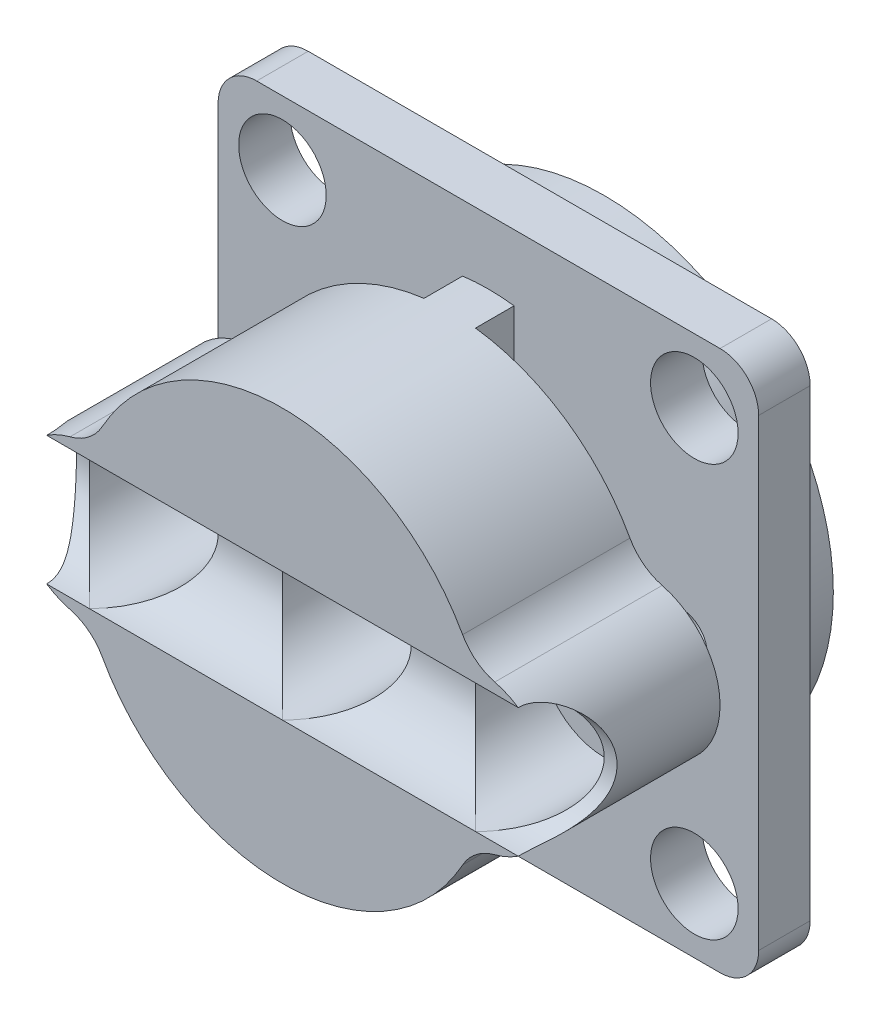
from build123d import *

# Parameters (mm, degrees)
ESQUISSE1_W                                        = 21
ESQUISSE1_H                                        = 21
EXTRUSION1_DEPTH                                   = 2
ESQUISSE2_R                                        = 8
EXTRUSION2_DEPTH                                   = 8
D_GAGEMENT_M31_D                                   = 3.4
R_P_TITION_LIN_AIRE1_COUNT                         = 2
R_P_TITION_LIN_AIRE1_PITCH                         = 16
R_P_TITION_LIN_AIRE1_COUNT_DIR2                    = 2
R_P_TITION_LIN_AIRE1_PITCH_DIR2                    = 16
CONG_1_R                                           = 1.5
ESQUISSE7_R                                        = 8.9
EXTRUSION4_DEPTH                                   = 2.5
ESQUISSE8_R                                        = 4.530803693
ENL_V_MAT_EXTRU_2_DEPTH                            = 2.5
ENL_V_MAT_EXTRU_6_REACH                            = 33.337
ESQUISSE9_R                                        = 2.5
ESQUISSE10_R                                       = 3
EXTRUSION5_DEPTH                                   = 8
CONG_2_R                                           = 2
ESQUISSE11_W                                       = 9.5
ESQUISSE11_H                                       = 1.5
ENL_V_MAT_EXTRU_7_DEPTH                            = 32.336879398
CHAMBRAGE_POUR_VIS_T_TE_RONDE_BOMB_E_M_D           = 2.2
CHAMBRAGE_POUR_VIS_T_TE_RONDE_BOMB_E_M_DEPTH       = 6.5
CHAMBRAGE_POUR_VIS_T_TE_RONDE_BOMB_E_M_CBORE_D     = 5
CHAMBRAGE_POUR_VIS_T_TE_RONDE_BOMB_E_M_CBORE_DEPTH = 5
ESQUISSE20_R                                       = 2.5
ENL_V_MAT_EXTRU_9_DEPTH                            = 32.336879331
CHAMBRAGE_POUR_VIS_T_TE_RONDE_BOMB_2_D             = 2.2
CHAMBRAGE_POUR_VIS_T_TE_RONDE_BOMB_2_DEPTH         = 6.5
CHAMBRAGE_POUR_VIS_T_TE_RONDE_BOMB_2_CBORE_D       = 5
CHAMBRAGE_POUR_VIS_T_TE_RONDE_BOMB_2_CBORE_DEPTH   = 5
TROU_TARAUD_M2X0_42_D                              = 2
TROU_TARAUD_M2X0_43_D                              = 2


with BuildPart() as part:
    # Esquisse1 → Extrusion1 (new body)
    with BuildSketch(Plane.XY):
        with Locations((-10.5, 10.5)):
            Rectangle(ESQUISSE1_W, ESQUISSE1_H)
    extrude(amount=EXTRUSION1_DEPTH)

    # Esquisse2 → Extrusion2 (add)
    with BuildSketch(Plane.XY.offset(2)):
        with Locations((-10.5, 10.5)):
            Circle(ESQUISSE2_R)
    extrude(amount=EXTRUSION2_DEPTH)

    # D_gagement M31 (through all)
    with Locations(Plane.XY.offset(2)):
        with Locations((-2.5, 18.5)):
            d_gagement_m31 = Hole(D_GAGEMENT_M31_D / 2)

    # R_p_tition lin_aire1: D_gagement M31 2 × 2
    with Locations(*[(-j * R_P_TITION_LIN_AIRE1_PITCH_DIR2, -i * R_P_TITION_LIN_AIRE1_PITCH, 0) for i in range(R_P_TITION_LIN_AIRE1_COUNT) for j in range(R_P_TITION_LIN_AIRE1_COUNT_DIR2) if (i, j) != (0, 0)]):
        add(d_gagement_m31, mode=Mode.SUBTRACT)

    # Cong_1
    cong_1_edges = [part.edges().sort_by_distance(p)[0] for p in [
        (-21, 21, 1),
        (0, 21, 1),
        (0, 0, 1),
        (-21, 0, 1),
    ]]
    fillet(cong_1_edges, radius=CONG_1_R)

    # Esquisse7 → Extrusion4 (add)
    with BuildSketch(Plane(origin=(0, 0, 0), x_dir=(-1, 0, 0), z_dir=(0, 0, -1))):
        with Locations(Location((10.5, 10.5, 0), (0, 0, 180))):
            Circle(ESQUISSE7_R)
    extrude(amount=EXTRUSION4_DEPTH)

    # Esquisse8 → Enl_v. mat.-Extru.2 (cut)
    with BuildSketch(Plane(origin=(0, 0, -2.5), x_dir=(-1, 0, 0), z_dir=(0, 0, -1))):
        with Locations((10.5, 10.5)):
            Circle(ESQUISSE8_R)
    extrude(amount=-ENL_V_MAT_EXTRU_2_DEPTH, mode=Mode.SUBTRACT)

    # Esquisse9 → Enl_v. mat.-Extru.6 (cut, up to next)
    with BuildSketch(Plane(origin=(0, 0, 0), x_dir=(-1, 0, 0), z_dir=(0, 0, -1)), mode=Mode.PRIVATE) as enl_v_mat_extru_6_sk1:
        with Locations((10.5, 10.5)):
            Circle(ESQUISSE9_R)
    enl_v_mat_extru_6_tool1 = extrude(enl_v_mat_extru_6_sk1.sketch, amount=-ENL_V_MAT_EXTRU_6_REACH, mode=Mode.PRIVATE) & part.part
    add(enl_v_mat_extru_6_tool1.solids().sort_by_distance((-10.5, 10.5, 0))[0], mode=Mode.SUBTRACT)

    # Esquisse10 → Extrusion5 (add)
    with BuildSketch(Plane.XY.offset(2)):
        with Locations((-18, 10.5)):
            Circle(ESQUISSE10_R)
        with Locations((-3, 10.5)):
            Circle(ESQUISSE10_R)
    extrude(amount=EXTRUSION5_DEPTH)

    # Cong_2
    cong_2_edges = [part.edges().sort_by_distance(p)[0] for p in [
        (-17.916666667, 13.498842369, 6),
        (-17.916666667, 7.501157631, 6),
        (-3.083333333, 7.501157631, 6),
        (-3.083333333, 13.498842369, 6),
    ]]
    fillet(cong_2_edges, radius=CONG_2_R)

    # Esquisse11 → Enl_v. mat.-Extru.7 (cut, through all)
    with BuildSketch(Plane(origin=(0, 21, 0), x_dir=(-1, 0, 0), z_dir=(0, 1, 0))):
        with Locations((4.75, 2.75)):
            Rectangle(ESQUISSE11_W, ESQUISSE11_H)
        with Locations((16.25, 2.75)):
            Rectangle(ESQUISSE11_W, ESQUISSE11_H)
    extrude(amount=-ENL_V_MAT_EXTRU_7_DEPTH, mode=Mode.SUBTRACT)

    # Chambrage pour vis _ t_te ronde bomb_e M
    with Locations(Plane.XY.offset(10)):
        with Locations((-18, 10.5)):
            CounterBoreHole(CHAMBRAGE_POUR_VIS_T_TE_RONDE_BOMB_E_M_D / 2, CHAMBRAGE_POUR_VIS_T_TE_RONDE_BOMB_E_M_CBORE_D / 2, CHAMBRAGE_POUR_VIS_T_TE_RONDE_BOMB_E_M_CBORE_DEPTH, depth=CHAMBRAGE_POUR_VIS_T_TE_RONDE_BOMB_E_M_DEPTH)

    # Esquisse20 → Enl_v. mat.-Extru.9 (cut, through all)
    with BuildSketch(Plane.ZY.offset(21)):
        with Locations((10, 10.5)):
            Circle(ESQUISSE20_R)
    extrude(amount=-ENL_V_MAT_EXTRU_9_DEPTH, mode=Mode.SUBTRACT)

    # Chambrage pour vis _ t_te ronde bomb 2
    with Locations(Plane.XY.offset(10)):
        with Locations((-3, 10.5)):
            CounterBoreHole(CHAMBRAGE_POUR_VIS_T_TE_RONDE_BOMB_2_D / 2, CHAMBRAGE_POUR_VIS_T_TE_RONDE_BOMB_2_CBORE_D / 2, CHAMBRAGE_POUR_VIS_T_TE_RONDE_BOMB_2_CBORE_DEPTH, depth=CHAMBRAGE_POUR_VIS_T_TE_RONDE_BOMB_2_DEPTH)

    # Trou taraud_ M2x0.42 (through all)
    with Locations(Plane.XY.offset(2)):
        with Locations((-18, 10.5)):
            Hole(TROU_TARAUD_M2X0_42_D / 2)

    # Trou taraud_ M2x0.43 (through all)
    with Locations(Plane.XY.offset(2)):
        with Locations((-3, 10.5)):
            Hole(TROU_TARAUD_M2X0_43_D / 2)


solid = part.part
